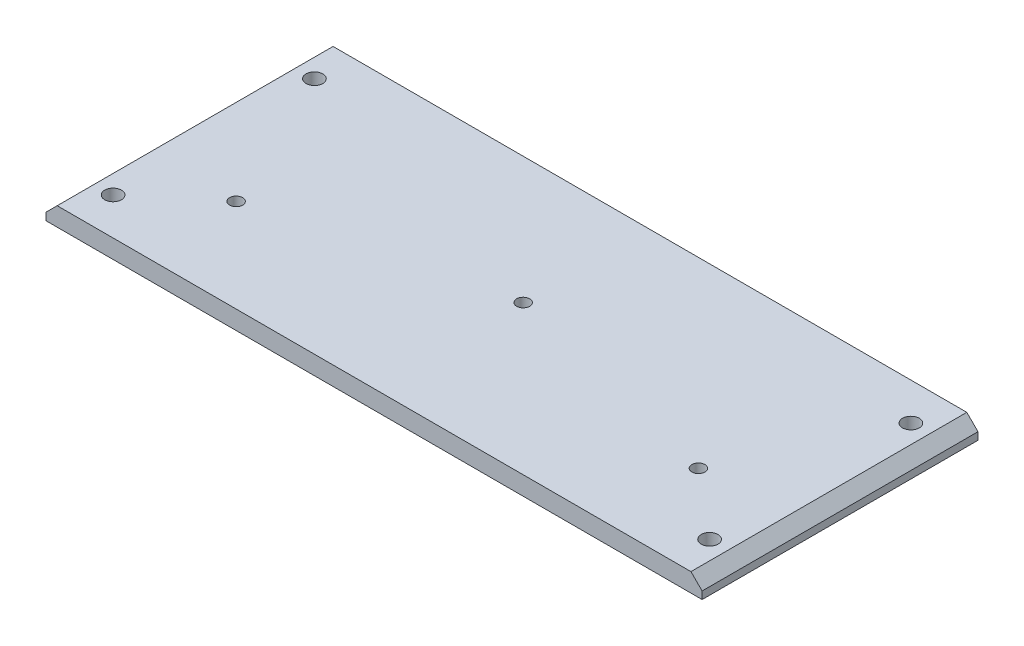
ISO-10303-21;
HEADER;
FILE_DESCRIPTION(('STEP AP214'),'2;1');
FILE_NAME('part.step','',(''),(''),'','','');
FILE_SCHEMA(('AUTOMOTIVE_DESIGN { 1 0 10303 214 1 1 1 1 }'));
ENDSEC;
DATA;
#1=APPLICATION_CONTEXT('core data for automotive mechanical design processes');
#2=APPLICATION_PROTOCOL_DEFINITION('international standard','automotive_design',2000,#1);
#3=PRODUCT_CONTEXT('',#1,'mechanical');
#4=PRODUCT('Part','Part','',(#3));
#5=PRODUCT_RELATED_PRODUCT_CATEGORY('part','',(#4));
#6=PRODUCT_DEFINITION_FORMATION('','',#4);
#7=PRODUCT_DEFINITION_CONTEXT('part definition',#1,'design');
#8=PRODUCT_DEFINITION('design','',#6,#7);
#9=PRODUCT_DEFINITION_SHAPE('','',#8);
#10=(LENGTH_UNIT() NAMED_UNIT(*) SI_UNIT(.MILLI.,.METRE.));
#11=(NAMED_UNIT(*) PLANE_ANGLE_UNIT() SI_UNIT($,.RADIAN.));
#12=(NAMED_UNIT(*) SI_UNIT($,.STERADIAN.) SOLID_ANGLE_UNIT());
#13=UNCERTAINTY_MEASURE_WITH_UNIT(LENGTH_MEASURE(1.E-05),#10,'distance_accuracy_value','');
#14=(GEOMETRIC_REPRESENTATION_CONTEXT(3) GLOBAL_UNCERTAINTY_ASSIGNED_CONTEXT((#13)) GLOBAL_UNIT_ASSIGNED_CONTEXT((#10,
#11,#12)) REPRESENTATION_CONTEXT('',''));
#15=CARTESIAN_POINT('',(0.,0.,0.));
#16=DIRECTION('',(0.,0.,1.));
#17=DIRECTION('',(1.,0.,0.));
#18=AXIS2_PLACEMENT_3D('',#15,#16,#17);
#19=CARTESIAN_POINT('',(0.,5.,-74.));
#20=DIRECTION('',(0.,-1.,0.));
#21=DIRECTION('',(0.,0.,-1.));
#22=AXIS2_PLACEMENT_3D('',#19,#20,#21);
#23=PLANE('',#22);
#24=CARTESIAN_POINT('',(26.,5.,-25.));
#25=DIRECTION('',(0.,1.,0.));
#26=DIRECTION('',(0.,0.,1.));
#27=AXIS2_PLACEMENT_3D('',#24,#25,#26);
#28=CIRCLE('',#27,1.75);
#29=CARTESIAN_POINT('',(26.,5.,-23.25));
#30=VERTEX_POINT('',#29);
#31=EDGE_CURVE('E284',#30,#30,#28,.T.);
#32=ORIENTED_EDGE('',*,*,#31,.F.);
#33=EDGE_LOOP('',(#32));
#34=FACE_BOUND('',#33,.T.);
#35=CARTESIAN_POINT('',(168.,5.,-10.));
#36=DIRECTION('',(0.,1.,0.));
#37=DIRECTION('',(0.,0.,1.));
#38=AXIS2_PLACEMENT_3D('',#35,#36,#37);
#39=CIRCLE('',#38,2.25000000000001);
#40=CARTESIAN_POINT('',(168.,5.,-7.74999999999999));
#41=VERTEX_POINT('',#40);
#42=EDGE_CURVE('E305',#41,#41,#39,.T.);
#43=ORIENTED_EDGE('',*,*,#42,.F.);
#44=EDGE_LOOP('',(#43));
#45=FACE_BOUND('',#44,.T.);
#46=CARTESIAN_POINT('',(8.,5.,-64.));
#47=DIRECTION('',(0.,1.,0.));
#48=DIRECTION('',(0.,0.,1.));
#49=AXIS2_PLACEMENT_3D('',#46,#47,#48);
#50=CIRCLE('',#49,2.25);
#51=CARTESIAN_POINT('',(8.,5.,-61.75));
#52=VERTEX_POINT('',#51);
#53=EDGE_CURVE('E317',#52,#52,#50,.T.);
#54=ORIENTED_EDGE('',*,*,#53,.F.);
#55=EDGE_LOOP('',(#54));
#56=FACE_BOUND('',#55,.T.);
#57=DIRECTION('',(-1.,0.,0.));
#58=VECTOR('',#57,1.);
#59=CARTESIAN_POINT('',(0.,5.,-74.));
#60=LINE('',#59,#58);
#61=CARTESIAN_POINT('',(173.,5.,-74.));
#62=VERTEX_POINT('',#61);
#63=CARTESIAN_POINT('',(3.,5.,-74.));
#64=VERTEX_POINT('',#63);
#65=EDGE_CURVE('E118',#62,#64,#60,.T.);
#66=ORIENTED_EDGE('',*,*,#65,.T.);
#67=DIRECTION('',(0.,0.,1.));
#68=VECTOR('',#67,1.);
#69=CARTESIAN_POINT('',(3.,5.,-74.));
#70=LINE('',#69,#68);
#71=CARTESIAN_POINT('',(3.,5.,0.));
#72=VERTEX_POINT('',#71);
#73=EDGE_CURVE('E127',#64,#72,#70,.T.);
#74=ORIENTED_EDGE('',*,*,#73,.T.);
#75=DIRECTION('',(1.,0.,0.));
#76=VECTOR('',#75,1.);
#77=CARTESIAN_POINT('',(0.,5.,0.));
#78=LINE('',#77,#76);
#79=CARTESIAN_POINT('',(173.,5.,0.));
#80=VERTEX_POINT('',#79);
#81=EDGE_CURVE('E115',#72,#80,#78,.T.);
#82=ORIENTED_EDGE('',*,*,#81,.T.);
#83=DIRECTION('',(0.,0.,-1.));
#84=VECTOR('',#83,1.);
#85=CARTESIAN_POINT('',(173.,5.,-74.));
#86=LINE('',#85,#84);
#87=EDGE_CURVE('E91',#80,#62,#86,.T.);
#88=ORIENTED_EDGE('',*,*,#87,.T.);
#89=EDGE_LOOP('',(#66,#74,#82,#88));
#90=FACE_BOUND('',#89,.T.);
#91=CARTESIAN_POINT('',(8.,5.,-10.));
#92=DIRECTION('',(0.,1.,0.));
#93=DIRECTION('',(0.,0.,1.));
#94=AXIS2_PLACEMENT_3D('',#91,#92,#93);
#95=CIRCLE('',#94,2.25);
#96=CARTESIAN_POINT('',(8.,5.,-7.75));
#97=VERTEX_POINT('',#96);
#98=EDGE_CURVE('E105',#97,#97,#95,.T.);
#99=ORIENTED_EDGE('',*,*,#98,.F.);
#100=EDGE_LOOP('',(#99));
#101=FACE_BOUND('',#100,.T.);
#102=CARTESIAN_POINT('',(168.,5.,-64.));
#103=DIRECTION('',(0.,1.,0.));
#104=DIRECTION('',(0.,0.,1.));
#105=AXIS2_PLACEMENT_3D('',#102,#103,#104);
#106=CIRCLE('',#105,2.25000000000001);
#107=CARTESIAN_POINT('',(168.,5.,-61.75));
#108=VERTEX_POINT('',#107);
#109=EDGE_CURVE('E311',#108,#108,#106,.T.);
#110=ORIENTED_EDGE('',*,*,#109,.F.);
#111=EDGE_LOOP('',(#110));
#112=FACE_BOUND('',#111,.T.);
#113=CARTESIAN_POINT('',(88.,5.,-40.));
#114=DIRECTION('',(0.,1.,0.));
#115=DIRECTION('',(0.,0.,1.));
#116=AXIS2_PLACEMENT_3D('',#113,#114,#115);
#117=CIRCLE('',#116,1.75);
#118=CARTESIAN_POINT('',(88.,5.,-38.25));
#119=VERTEX_POINT('',#118);
#120=EDGE_CURVE('E299',#119,#119,#117,.T.);
#121=ORIENTED_EDGE('',*,*,#120,.F.);
#122=EDGE_LOOP('',(#121));
#123=FACE_BOUND('',#122,.T.);
#124=CARTESIAN_POINT('',(150.,5.,-25.));
#125=DIRECTION('',(0.,1.,0.));
#126=DIRECTION('',(0.,0.,1.));
#127=AXIS2_PLACEMENT_3D('',#124,#125,#126);
#128=CIRCLE('',#127,1.75000000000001);
#129=CARTESIAN_POINT('',(150.,5.,-23.25));
#130=VERTEX_POINT('',#129);
#131=EDGE_CURVE('E288',#130,#130,#128,.T.);
#132=ORIENTED_EDGE('',*,*,#131,.F.);
#133=EDGE_LOOP('',(#132));
#134=FACE_BOUND('',#133,.T.);
#135=ADVANCED_FACE('F30',(#34,#45,#56,#90,#101,#112,#123,#134),#23,.F.);
#136=CARTESIAN_POINT('',(0.,0.,-74.));
#137=DIRECTION('',(0.,-1.,0.));
#138=DIRECTION('',(0.,0.,-1.));
#139=AXIS2_PLACEMENT_3D('',#136,#137,#138);
#140=PLANE('',#139);
#141=CARTESIAN_POINT('',(26.,0.,-25.));
#142=DIRECTION('',(0.,1.,0.));
#143=DIRECTION('',(0.,0.,1.));
#144=AXIS2_PLACEMENT_3D('',#141,#142,#143);
#145=CIRCLE('',#144,1.75);
#146=CARTESIAN_POINT('',(26.,0.,-23.25));
#147=VERTEX_POINT('',#146);
#148=EDGE_CURVE('E287',#147,#147,#145,.T.);
#149=ORIENTED_EDGE('',*,*,#148,.T.);
#150=EDGE_LOOP('',(#149));
#151=FACE_BOUND('',#150,.T.);
#152=CARTESIAN_POINT('',(168.,0.,-10.));
#153=DIRECTION('',(0.,1.,0.));
#154=DIRECTION('',(0.,0.,1.));
#155=AXIS2_PLACEMENT_3D('',#152,#153,#154);
#156=CIRCLE('',#155,2.25000000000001);
#157=CARTESIAN_POINT('',(168.,0.,-7.74999999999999));
#158=VERTEX_POINT('',#157);
#159=EDGE_CURVE('E302',#158,#158,#156,.T.);
#160=ORIENTED_EDGE('',*,*,#159,.T.);
#161=EDGE_LOOP('',(#160));
#162=FACE_BOUND('',#161,.T.);
#163=CARTESIAN_POINT('',(8.,0.,-64.));
#164=DIRECTION('',(0.,1.,0.));
#165=DIRECTION('',(0.,0.,1.));
#166=AXIS2_PLACEMENT_3D('',#163,#164,#165);
#167=CIRCLE('',#166,2.25);
#168=CARTESIAN_POINT('',(8.,0.,-61.75));
#169=VERTEX_POINT('',#168);
#170=EDGE_CURVE('E314',#169,#169,#167,.T.);
#171=ORIENTED_EDGE('',*,*,#170,.T.);
#172=EDGE_LOOP('',(#171));
#173=FACE_BOUND('',#172,.T.);
#174=DIRECTION('',(0.,0.,1.));
#175=VECTOR('',#174,1.);
#176=CARTESIAN_POINT('',(0.,0.,0.));
#177=LINE('',#176,#175);
#178=CARTESIAN_POINT('',(0.,0.,-74.));
#179=VERTEX_POINT('',#178);
#180=CARTESIAN_POINT('',(0.,0.,0.));
#181=VERTEX_POINT('',#180);
#182=EDGE_CURVE('E99',#179,#181,#177,.T.);
#183=ORIENTED_EDGE('',*,*,#182,.F.);
#184=DIRECTION('',(-1.,0.,0.));
#185=VECTOR('',#184,1.);
#186=CARTESIAN_POINT('',(0.,0.,-74.));
#187=LINE('',#186,#185);
#188=CARTESIAN_POINT('',(176.,0.,-74.));
#189=VERTEX_POINT('',#188);
#190=EDGE_CURVE('E113',#189,#179,#187,.T.);
#191=ORIENTED_EDGE('',*,*,#190,.F.);
#192=DIRECTION('',(0.,0.,-1.));
#193=VECTOR('',#192,1.);
#194=CARTESIAN_POINT('',(176.,0.,0.));
#195=LINE('',#194,#193);
#196=CARTESIAN_POINT('',(176.,0.,0.));
#197=VERTEX_POINT('',#196);
#198=EDGE_CURVE('E101',#197,#189,#195,.T.);
#199=ORIENTED_EDGE('',*,*,#198,.F.);
#200=DIRECTION('',(1.,0.,0.));
#201=VECTOR('',#200,1.);
#202=CARTESIAN_POINT('',(0.,0.,0.));
#203=LINE('',#202,#201);
#204=EDGE_CURVE('E87',#181,#197,#203,.T.);
#205=ORIENTED_EDGE('',*,*,#204,.F.);
#206=EDGE_LOOP('',(#183,#191,#199,#205));
#207=FACE_BOUND('',#206,.T.);
#208=CARTESIAN_POINT('',(8.,0.,-10.));
#209=DIRECTION('',(0.,1.,0.));
#210=DIRECTION('',(0.,0.,1.));
#211=AXIS2_PLACEMENT_3D('',#208,#209,#210);
#212=CIRCLE('',#211,2.25);
#213=CARTESIAN_POINT('',(8.,0.,-7.75));
#214=VERTEX_POINT('',#213);
#215=EDGE_CURVE('E108',#214,#214,#212,.T.);
#216=ORIENTED_EDGE('',*,*,#215,.T.);
#217=EDGE_LOOP('',(#216));
#218=FACE_BOUND('',#217,.T.);
#219=CARTESIAN_POINT('',(168.,0.,-64.));
#220=DIRECTION('',(0.,1.,0.));
#221=DIRECTION('',(0.,0.,1.));
#222=AXIS2_PLACEMENT_3D('',#219,#220,#221);
#223=CIRCLE('',#222,2.25000000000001);
#224=CARTESIAN_POINT('',(168.,0.,-61.75));
#225=VERTEX_POINT('',#224);
#226=EDGE_CURVE('E308',#225,#225,#223,.T.);
#227=ORIENTED_EDGE('',*,*,#226,.T.);
#228=EDGE_LOOP('',(#227));
#229=FACE_BOUND('',#228,.T.);
#230=CARTESIAN_POINT('',(88.,0.,-40.));
#231=DIRECTION('',(0.,1.,0.));
#232=DIRECTION('',(0.,0.,1.));
#233=AXIS2_PLACEMENT_3D('',#230,#231,#232);
#234=CIRCLE('',#233,1.75);
#235=CARTESIAN_POINT('',(88.,0.,-38.25));
#236=VERTEX_POINT('',#235);
#237=EDGE_CURVE('E290',#236,#236,#234,.T.);
#238=ORIENTED_EDGE('',*,*,#237,.T.);
#239=EDGE_LOOP('',(#238));
#240=FACE_BOUND('',#239,.T.);
#241=CARTESIAN_POINT('',(150.,0.,-25.));
#242=DIRECTION('',(0.,1.,0.));
#243=DIRECTION('',(0.,0.,1.));
#244=AXIS2_PLACEMENT_3D('',#241,#242,#243);
#245=CIRCLE('',#244,1.75000000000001);
#246=CARTESIAN_POINT('',(150.,0.,-23.25));
#247=VERTEX_POINT('',#246);
#248=EDGE_CURVE('E293',#247,#247,#245,.T.);
#249=ORIENTED_EDGE('',*,*,#248,.T.);
#250=EDGE_LOOP('',(#249));
#251=FACE_BOUND('',#250,.T.);
#252=ADVANCED_FACE('F96',(#151,#162,#173,#207,#218,#229,#240,#251),#140,.T.);
#253=CARTESIAN_POINT('',(0.,5.,0.));
#254=DIRECTION('',(1.,0.,0.));
#255=DIRECTION('',(0.,0.,-1.));
#256=AXIS2_PLACEMENT_3D('',#253,#254,#255);
#257=PLANE('',#256);
#258=DIRECTION('',(0.,-1.,0.));
#259=VECTOR('',#258,1.);
#260=CARTESIAN_POINT('',(0.,5.,0.));
#261=LINE('',#260,#259);
#262=CARTESIAN_POINT('',(0.,2.,0.));
#263=VERTEX_POINT('',#262);
#264=EDGE_CURVE('E82',#263,#181,#261,.T.);
#265=ORIENTED_EDGE('',*,*,#264,.F.);
#266=DIRECTION('',(0.,0.,-1.));
#267=VECTOR('',#266,1.);
#268=CARTESIAN_POINT('',(0.,2.,0.));
#269=LINE('',#268,#267);
#270=CARTESIAN_POINT('',(0.,2.,-74.));
#271=VERTEX_POINT('',#270);
#272=EDGE_CURVE('E53',#263,#271,#269,.T.);
#273=ORIENTED_EDGE('',*,*,#272,.T.);
#274=DIRECTION('',(0.,-1.,0.));
#275=VECTOR('',#274,1.);
#276=CARTESIAN_POINT('',(0.,5.,-74.));
#277=LINE('',#276,#275);
#278=EDGE_CURVE('E103',#271,#179,#277,.T.);
#279=ORIENTED_EDGE('',*,*,#278,.T.);
#280=ORIENTED_EDGE('',*,*,#182,.T.);
#281=EDGE_LOOP('',(#265,#273,#279,#280));
#282=FACE_BOUND('',#281,.T.);
#283=ADVANCED_FACE('F32',(#282),#257,.F.);
#284=CARTESIAN_POINT('',(0.,5.,0.));
#285=DIRECTION('',(0.,0.,-1.));
#286=DIRECTION('',(-1.,0.,0.));
#287=AXIS2_PLACEMENT_3D('',#284,#285,#286);
#288=PLANE('',#287);
#289=ORIENTED_EDGE('',*,*,#81,.F.);
#290=DIRECTION('',(0.707106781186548,0.707106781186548,0.));
#291=VECTOR('',#290,1.);
#292=CARTESIAN_POINT('',(3.,5.,0.));
#293=LINE('',#292,#291);
#294=EDGE_CURVE('E89',#72,#263,#293,.F.);
#295=ORIENTED_EDGE('',*,*,#294,.T.);
#296=ORIENTED_EDGE('',*,*,#264,.T.);
#297=ORIENTED_EDGE('',*,*,#204,.T.);
#298=DIRECTION('',(0.,-1.,0.));
#299=VECTOR('',#298,1.);
#300=CARTESIAN_POINT('',(176.,5.,0.));
#301=LINE('',#300,#299);
#302=CARTESIAN_POINT('',(176.,2.,0.));
#303=VERTEX_POINT('',#302);
#304=EDGE_CURVE('E92',#303,#197,#301,.T.);
#305=ORIENTED_EDGE('',*,*,#304,.F.);
#306=DIRECTION('',(0.707106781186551,-0.707106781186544,0.));
#307=VECTOR('',#306,1.);
#308=CARTESIAN_POINT('',(173.,5.,0.));
#309=LINE('',#308,#307);
#310=EDGE_CURVE('E130',#303,#80,#309,.F.);
#311=ORIENTED_EDGE('',*,*,#310,.T.);
#312=EDGE_LOOP('',(#289,#295,#296,#297,#305,#311));
#313=FACE_BOUND('',#312,.T.);
#314=ADVANCED_FACE('F85',(#313),#288,.F.);
#315=CARTESIAN_POINT('',(176.,5.,0.));
#316=DIRECTION('',(-1.,0.,0.));
#317=DIRECTION('',(0.,0.,1.));
#318=AXIS2_PLACEMENT_3D('',#315,#316,#317);
#319=PLANE('',#318);
#320=DIRECTION('',(0.,-1.,0.));
#321=VECTOR('',#320,1.);
#322=CARTESIAN_POINT('',(176.,5.,-74.));
#323=LINE('',#322,#321);
#324=CARTESIAN_POINT('',(176.,2.,-74.));
#325=VERTEX_POINT('',#324);
#326=EDGE_CURVE('E122',#325,#189,#323,.T.);
#327=ORIENTED_EDGE('',*,*,#326,.F.);
#328=DIRECTION('',(0.,0.,1.));
#329=VECTOR('',#328,1.);
#330=CARTESIAN_POINT('',(176.,2.,0.));
#331=LINE('',#330,#329);
#332=EDGE_CURVE('E11',#325,#303,#331,.T.);
#333=ORIENTED_EDGE('',*,*,#332,.T.);
#334=ORIENTED_EDGE('',*,*,#304,.T.);
#335=ORIENTED_EDGE('',*,*,#198,.T.);
#336=EDGE_LOOP('',(#327,#333,#334,#335));
#337=FACE_BOUND('',#336,.T.);
#338=ADVANCED_FACE('F170',(#337),#319,.F.);
#339=CARTESIAN_POINT('',(0.,5.,-74.));
#340=DIRECTION('',(0.,0.,1.));
#341=DIRECTION('',(1.,0.,0.));
#342=AXIS2_PLACEMENT_3D('',#339,#340,#341);
#343=PLANE('',#342);
#344=ORIENTED_EDGE('',*,*,#278,.F.);
#345=DIRECTION('',(-0.707106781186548,-0.707106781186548,0.));
#346=VECTOR('',#345,1.);
#347=CARTESIAN_POINT('',(3.,5.,-74.));
#348=LINE('',#347,#346);
#349=EDGE_CURVE('E38',#271,#64,#348,.F.);
#350=ORIENTED_EDGE('',*,*,#349,.T.);
#351=ORIENTED_EDGE('',*,*,#65,.F.);
#352=DIRECTION('',(-0.707106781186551,0.707106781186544,0.));
#353=VECTOR('',#352,1.);
#354=CARTESIAN_POINT('',(173.,5.,-74.));
#355=LINE('',#354,#353);
#356=EDGE_CURVE('E45',#62,#325,#355,.F.);
#357=ORIENTED_EDGE('',*,*,#356,.T.);
#358=ORIENTED_EDGE('',*,*,#326,.T.);
#359=ORIENTED_EDGE('',*,*,#190,.T.);
#360=EDGE_LOOP('',(#344,#350,#351,#357,#358,#359));
#361=FACE_BOUND('',#360,.T.);
#362=ADVANCED_FACE('F135',(#361),#343,.F.);
#363=CARTESIAN_POINT('',(8.,5.,-10.));
#364=DIRECTION('',(0.,-1.,0.));
#365=DIRECTION('',(0.,0.,-1.));
#366=AXIS2_PLACEMENT_3D('',#363,#364,#365);
#367=CYLINDRICAL_SURFACE('',#366,2.25);
#368=ORIENTED_EDGE('',*,*,#98,.T.);
#369=EDGE_LOOP('',(#368));
#370=FACE_BOUND('',#369,.T.);
#371=ORIENTED_EDGE('',*,*,#215,.F.);
#372=EDGE_LOOP('',(#371));
#373=FACE_BOUND('',#372,.T.);
#374=ADVANCED_FACE('F169',(#370,#373),#367,.F.);
#375=CARTESIAN_POINT('',(8.,5.,-64.));
#376=DIRECTION('',(0.,-1.,0.));
#377=DIRECTION('',(0.,0.,-1.));
#378=AXIS2_PLACEMENT_3D('',#375,#376,#377);
#379=CYLINDRICAL_SURFACE('',#378,2.25);
#380=ORIENTED_EDGE('',*,*,#53,.T.);
#381=EDGE_LOOP('',(#380));
#382=FACE_BOUND('',#381,.T.);
#383=ORIENTED_EDGE('',*,*,#170,.F.);
#384=EDGE_LOOP('',(#383));
#385=FACE_BOUND('',#384,.T.);
#386=ADVANCED_FACE('F193',(#382,#385),#379,.F.);
#387=CARTESIAN_POINT('',(168.,5.,-64.));
#388=DIRECTION('',(0.,-1.,0.));
#389=DIRECTION('',(0.,0.,-1.));
#390=AXIS2_PLACEMENT_3D('',#387,#388,#389);
#391=CYLINDRICAL_SURFACE('',#390,2.25000000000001);
#392=ORIENTED_EDGE('',*,*,#109,.T.);
#393=EDGE_LOOP('',(#392));
#394=FACE_BOUND('',#393,.T.);
#395=ORIENTED_EDGE('',*,*,#226,.F.);
#396=EDGE_LOOP('',(#395));
#397=FACE_BOUND('',#396,.T.);
#398=ADVANCED_FACE('F203',(#394,#397),#391,.F.);
#399=CARTESIAN_POINT('',(168.,5.,-10.));
#400=DIRECTION('',(0.,-1.,0.));
#401=DIRECTION('',(0.,0.,-1.));
#402=AXIS2_PLACEMENT_3D('',#399,#400,#401);
#403=CYLINDRICAL_SURFACE('',#402,2.25000000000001);
#404=ORIENTED_EDGE('',*,*,#42,.T.);
#405=EDGE_LOOP('',(#404));
#406=FACE_BOUND('',#405,.T.);
#407=ORIENTED_EDGE('',*,*,#159,.F.);
#408=EDGE_LOOP('',(#407));
#409=FACE_BOUND('',#408,.T.);
#410=ADVANCED_FACE('F213',(#406,#409),#403,.F.);
#411=CARTESIAN_POINT('',(88.,5.,-40.));
#412=DIRECTION('',(0.,-1.,0.));
#413=DIRECTION('',(0.,0.,-1.));
#414=AXIS2_PLACEMENT_3D('',#411,#412,#413);
#415=CYLINDRICAL_SURFACE('',#414,1.75);
#416=ORIENTED_EDGE('',*,*,#120,.T.);
#417=EDGE_LOOP('',(#416));
#418=FACE_BOUND('',#417,.T.);
#419=ORIENTED_EDGE('',*,*,#237,.F.);
#420=EDGE_LOOP('',(#419));
#421=FACE_BOUND('',#420,.T.);
#422=ADVANCED_FACE('F223',(#418,#421),#415,.F.);
#423=CARTESIAN_POINT('',(26.,5.,-25.));
#424=DIRECTION('',(0.,-1.,0.));
#425=DIRECTION('',(0.,0.,-1.));
#426=AXIS2_PLACEMENT_3D('',#423,#424,#425);
#427=CYLINDRICAL_SURFACE('',#426,1.75);
#428=ORIENTED_EDGE('',*,*,#31,.T.);
#429=EDGE_LOOP('',(#428));
#430=FACE_BOUND('',#429,.T.);
#431=ORIENTED_EDGE('',*,*,#148,.F.);
#432=EDGE_LOOP('',(#431));
#433=FACE_BOUND('',#432,.T.);
#434=ADVANCED_FACE('F152',(#430,#433),#427,.F.);
#435=CARTESIAN_POINT('',(150.,5.,-25.));
#436=DIRECTION('',(0.,-1.,0.));
#437=DIRECTION('',(0.,0.,-1.));
#438=AXIS2_PLACEMENT_3D('',#435,#436,#437);
#439=CYLINDRICAL_SURFACE('',#438,1.75000000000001);
#440=ORIENTED_EDGE('',*,*,#131,.T.);
#441=EDGE_LOOP('',(#440));
#442=FACE_BOUND('',#441,.T.);
#443=ORIENTED_EDGE('',*,*,#248,.F.);
#444=EDGE_LOOP('',(#443));
#445=FACE_BOUND('',#444,.T.);
#446=ADVANCED_FACE('F144',(#442,#445),#439,.F.);
#447=CARTESIAN_POINT('',(3.,5.,-74.));
#448=DIRECTION('',(0.707106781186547,-0.707106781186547,0.));
#449=DIRECTION('',(0.707106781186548,0.707106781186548,0.));
#450=AXIS2_PLACEMENT_3D('',#447,#448,#449);
#451=PLANE('',#450);
#452=ORIENTED_EDGE('',*,*,#349,.F.);
#453=ORIENTED_EDGE('',*,*,#272,.F.);
#454=ORIENTED_EDGE('',*,*,#294,.F.);
#455=ORIENTED_EDGE('',*,*,#73,.F.);
#456=EDGE_LOOP('',(#452,#453,#454,#455));
#457=FACE_BOUND('',#456,.T.);
#458=ADVANCED_FACE('F141',(#457),#451,.F.);
#459=CARTESIAN_POINT('',(173.,5.,-74.));
#460=DIRECTION('',(-0.707106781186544,-0.707106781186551,0.));
#461=DIRECTION('',(0.707106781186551,-0.707106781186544,0.));
#462=AXIS2_PLACEMENT_3D('',#459,#460,#461);
#463=PLANE('',#462);
#464=ORIENTED_EDGE('',*,*,#310,.F.);
#465=ORIENTED_EDGE('',*,*,#332,.F.);
#466=ORIENTED_EDGE('',*,*,#356,.F.);
#467=ORIENTED_EDGE('',*,*,#87,.F.);
#468=EDGE_LOOP('',(#464,#465,#466,#467));
#469=FACE_BOUND('',#468,.T.);
#470=ADVANCED_FACE('F143',(#469),#463,.F.);
#471=CLOSED_SHELL('',(#135,#252,#283,#314,#338,#362,#374,#386,#398,#410,#422,#434,#446,#458,#470));
#472=MANIFOLD_SOLID_BREP('B2',#471);
#473=ADVANCED_BREP_SHAPE_REPRESENTATION('',(#18,#472),#14);
#474=SHAPE_DEFINITION_REPRESENTATION(#9,#473);
ENDSEC;
END-ISO-10303-21;
